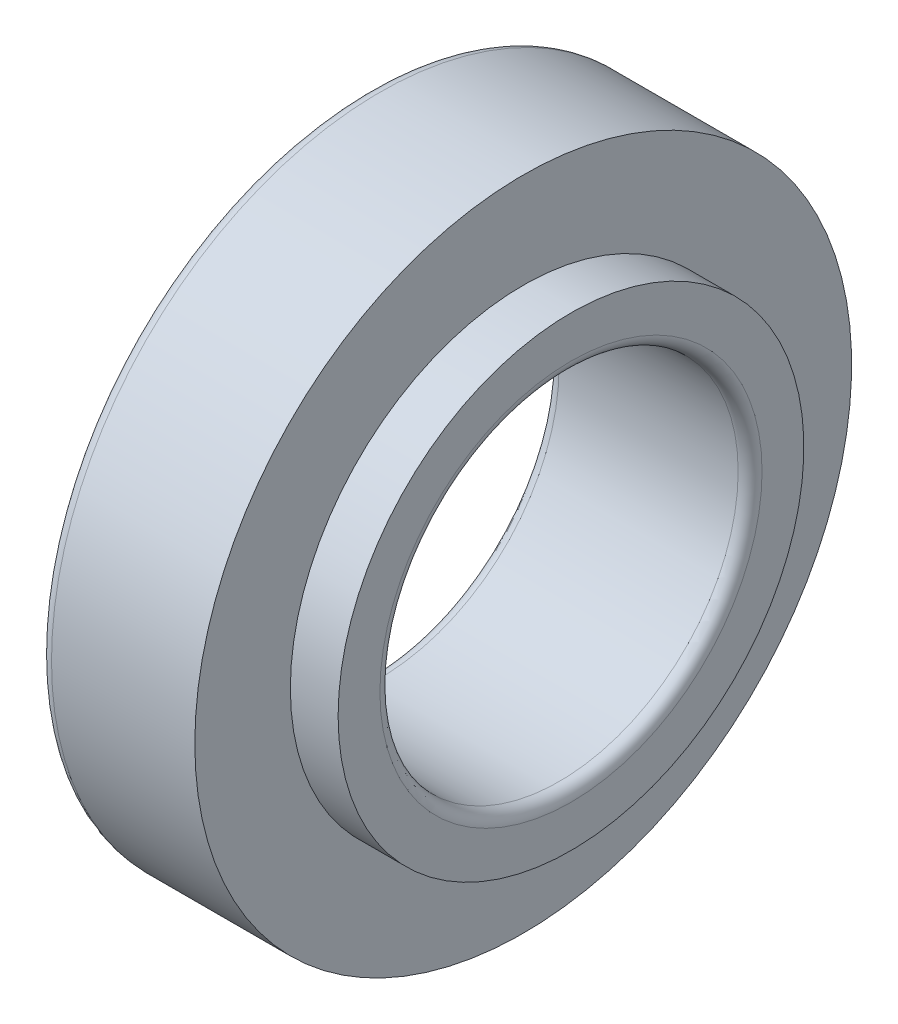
ISO-10303-21;
HEADER;
FILE_DESCRIPTION(('STEP AP214'),'2;1');
FILE_NAME('part.step','',(''),(''),'','','');
FILE_SCHEMA(('AUTOMOTIVE_DESIGN { 1 0 10303 214 1 1 1 1 }'));
ENDSEC;
DATA;
#1=APPLICATION_CONTEXT('core data for automotive mechanical design processes');
#2=APPLICATION_PROTOCOL_DEFINITION('international standard','automotive_design',2000,#1);
#3=PRODUCT_CONTEXT('',#1,'mechanical');
#4=PRODUCT('Part','Part','',(#3));
#5=PRODUCT_RELATED_PRODUCT_CATEGORY('part','',(#4));
#6=PRODUCT_DEFINITION_FORMATION('','',#4);
#7=PRODUCT_DEFINITION_CONTEXT('part definition',#1,'design');
#8=PRODUCT_DEFINITION('design','',#6,#7);
#9=PRODUCT_DEFINITION_SHAPE('','',#8);
#10=(LENGTH_UNIT() NAMED_UNIT(*) SI_UNIT(.MILLI.,.METRE.));
#11=(NAMED_UNIT(*) PLANE_ANGLE_UNIT() SI_UNIT($,.RADIAN.));
#12=(NAMED_UNIT(*) SI_UNIT($,.STERADIAN.) SOLID_ANGLE_UNIT());
#13=UNCERTAINTY_MEASURE_WITH_UNIT(LENGTH_MEASURE(1.E-05),#10,'distance_accuracy_value','');
#14=(GEOMETRIC_REPRESENTATION_CONTEXT(3) GLOBAL_UNCERTAINTY_ASSIGNED_CONTEXT((#13)) GLOBAL_UNIT_ASSIGNED_CONTEXT((#10,
#11,#12)) REPRESENTATION_CONTEXT('',''));
#15=CARTESIAN_POINT('',(0.,0.,0.));
#16=DIRECTION('',(0.,0.,1.));
#17=DIRECTION('',(1.,0.,0.));
#18=AXIS2_PLACEMENT_3D('',#15,#16,#17);
#19=CARTESIAN_POINT('',(12.9999999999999,27.4999999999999,0.));
#20=DIRECTION('',(-0.999999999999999,0.,0.));
#21=DIRECTION('',(0.,0.,1.));
#22=AXIS2_PLACEMENT_3D('',#19,#20,#21);
#23=PLANE('',#22);
#24=CARTESIAN_POINT('',(13.0000000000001,-2.25514051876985E-13,0.));
#25=DIRECTION('',(-0.999999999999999,0.,0.));
#26=DIRECTION('',(0.,0.,1.));
#27=AXIS2_PLACEMENT_3D('',#24,#25,#26);
#28=CIRCLE('',#27,27.5);
#29=CARTESIAN_POINT('',(13.0000000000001,0.,27.5));
#30=VERTEX_POINT('',#29);
#31=EDGE_CURVE('E77',#30,#30,#28,.T.);
#32=ORIENTED_EDGE('',*,*,#31,.F.);
#33=EDGE_LOOP('',(#32));
#34=FACE_BOUND('',#33,.T.);
#35=CARTESIAN_POINT('',(13.0000000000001,-2.25514051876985E-13,0.));
#36=DIRECTION('',(-0.999999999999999,0.,0.));
#37=DIRECTION('',(0.,0.,1.));
#38=AXIS2_PLACEMENT_3D('',#35,#36,#37);
#39=CIRCLE('',#38,19.5);
#40=CARTESIAN_POINT('',(13.0000000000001,0.,19.5));
#41=VERTEX_POINT('',#40);
#42=EDGE_CURVE('E10',#41,#41,#39,.T.);
#43=ORIENTED_EDGE('',*,*,#42,.T.);
#44=EDGE_LOOP('',(#43));
#45=FACE_BOUND('',#44,.T.);
#46=ADVANCED_FACE('F34',(#34,#45),#23,.F.);
#47=CARTESIAN_POINT('',(0.,0.,0.));
#48=DIRECTION('',(-0.999999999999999,0.,0.));
#49=DIRECTION('',(0.,0.,1.));
#50=AXIS2_PLACEMENT_3D('',#47,#48,#49);
#51=CYLINDRICAL_SURFACE('',#50,19.5);
#52=CARTESIAN_POINT('',(17.,-2.22044604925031E-13,1.11022302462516E-13));
#53=DIRECTION('',(-0.999999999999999,0.,0.));
#54=DIRECTION('',(0.,0.,1.));
#55=AXIS2_PLACEMENT_3D('',#52,#53,#54);
#56=CIRCLE('',#55,19.5);
#57=CARTESIAN_POINT('',(17.,0.,19.5));
#58=VERTEX_POINT('',#57);
#59=EDGE_CURVE('E40',#58,#58,#56,.T.);
#60=CARTESIAN_POINT('',(13.0000000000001,0.,19.5));
#61=CARTESIAN_POINT('',(13.0416666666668,0.,19.5));
#62=CARTESIAN_POINT('',(13.0833333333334,0.,19.5));
#63=CARTESIAN_POINT('',(13.1666666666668,0.,19.5));
#64=CARTESIAN_POINT('',(13.2083333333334,0.,19.5));
#65=CARTESIAN_POINT('',(13.2916666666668,0.,19.5));
#66=CARTESIAN_POINT('',(13.3333333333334,0.,19.5));
#67=CARTESIAN_POINT('',(13.4166666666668,0.,19.5));
#68=CARTESIAN_POINT('',(13.4583333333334,0.,19.5));
#69=CARTESIAN_POINT('',(13.5416666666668,0.,19.5));
#70=CARTESIAN_POINT('',(13.5833333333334,0.,19.5));
#71=CARTESIAN_POINT('',(13.6666666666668,0.,19.5));
#72=CARTESIAN_POINT('',(13.7083333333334,0.,19.5));
#73=CARTESIAN_POINT('',(13.7916666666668,0.,19.5));
#74=CARTESIAN_POINT('',(13.8333333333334,0.,19.5));
#75=CARTESIAN_POINT('',(13.9166666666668,0.,19.5));
#76=CARTESIAN_POINT('',(13.9583333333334,0.,19.5));
#77=CARTESIAN_POINT('',(14.0416666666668,0.,19.5));
#78=CARTESIAN_POINT('',(14.0833333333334,0.,19.5));
#79=CARTESIAN_POINT('',(14.1666666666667,0.,19.5));
#80=CARTESIAN_POINT('',(14.2083333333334,0.,19.5));
#81=CARTESIAN_POINT('',(14.2916666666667,0.,19.5));
#82=CARTESIAN_POINT('',(14.3333333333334,0.,19.5));
#83=CARTESIAN_POINT('',(14.4166666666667,0.,19.5));
#84=CARTESIAN_POINT('',(14.4583333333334,0.,19.5));
#85=CARTESIAN_POINT('',(14.5416666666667,0.,19.5));
#86=CARTESIAN_POINT('',(14.5833333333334,0.,19.5));
#87=CARTESIAN_POINT('',(14.6666666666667,0.,19.5));
#88=CARTESIAN_POINT('',(14.7083333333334,0.,19.5));
#89=CARTESIAN_POINT('',(14.7916666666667,0.,19.5));
#90=CARTESIAN_POINT('',(14.8333333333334,0.,19.5));
#91=CARTESIAN_POINT('',(14.9166666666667,0.,19.5));
#92=CARTESIAN_POINT('',(14.9583333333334,0.,19.5));
#93=CARTESIAN_POINT('',(15.0416666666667,0.,19.5));
#94=CARTESIAN_POINT('',(15.0833333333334,0.,19.5));
#95=CARTESIAN_POINT('',(15.1666666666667,0.,19.5));
#96=CARTESIAN_POINT('',(15.2083333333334,0.,19.5));
#97=CARTESIAN_POINT('',(15.2916666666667,0.,19.5));
#98=CARTESIAN_POINT('',(15.3333333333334,0.,19.5));
#99=CARTESIAN_POINT('',(15.4166666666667,0.,19.5));
#100=CARTESIAN_POINT('',(15.4583333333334,0.,19.5));
#101=CARTESIAN_POINT('',(15.5416666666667,0.,19.5));
#102=CARTESIAN_POINT('',(15.5833333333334,0.,19.5));
#103=CARTESIAN_POINT('',(15.6666666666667,0.,19.5));
#104=CARTESIAN_POINT('',(15.7083333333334,0.,19.5));
#105=CARTESIAN_POINT('',(15.7916666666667,0.,19.5));
#106=CARTESIAN_POINT('',(15.8333333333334,0.,19.5));
#107=CARTESIAN_POINT('',(15.9166666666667,0.,19.5));
#108=CARTESIAN_POINT('',(15.9583333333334,0.,19.5));
#109=CARTESIAN_POINT('',(16.0416666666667,0.,19.5));
#110=CARTESIAN_POINT('',(16.0833333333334,0.,19.5));
#111=CARTESIAN_POINT('',(16.1666666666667,0.,19.5));
#112=CARTESIAN_POINT('',(16.2083333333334,0.,19.5));
#113=CARTESIAN_POINT('',(16.2916666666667,0.,19.5));
#114=CARTESIAN_POINT('',(16.3333333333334,0.,19.5));
#115=CARTESIAN_POINT('',(16.4166666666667,0.,19.5));
#116=CARTESIAN_POINT('',(16.4583333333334,0.,19.5));
#117=CARTESIAN_POINT('',(16.5416666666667,0.,19.5));
#118=CARTESIAN_POINT('',(16.5833333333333,0.,19.5));
#119=CARTESIAN_POINT('',(16.6666666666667,0.,19.5));
#120=CARTESIAN_POINT('',(16.7083333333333,0.,19.5));
#121=CARTESIAN_POINT('',(16.7916666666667,0.,19.5));
#122=CARTESIAN_POINT('',(16.8333333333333,0.,19.5));
#123=CARTESIAN_POINT('',(16.9166666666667,0.,19.5));
#124=CARTESIAN_POINT('',(16.9583333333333,0.,19.5));
#125=CARTESIAN_POINT('',(17.,0.,19.5));
#126=B_SPLINE_CURVE_WITH_KNOTS('',3,(#60,#61,#62,#63,#64,#65,#66,#67,#68,#69,#70,#71,#72,#73,
#74,#75,#76,#77,#78,#79,#80,#81,#82,#83,#84,#85,#86,#87,#88,#89,#90,#91,#92,#93,#94,#95,#96,#97,
#98,#99,#100,#101,#102,#103,#104,#105,#106,#107,#108,#109,#110,#111,#112,#113,#114,#115,#116,
#117,#118,#119,#120,#121,#122,#123,#124,#125),.UNSPECIFIED.,.F.,.F.,(4,2,2,2,2,2,2,2,2,2,2,2,2,
2,2,2,2,2,2,2,2,2,2,2,2,2,2,2,2,2,2,2,4),(0.,0.124999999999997,0.249999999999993,
0.374999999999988,0.499999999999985,0.624999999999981,0.749999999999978,0.874999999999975,
0.999999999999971,1.12499999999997,1.24999999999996,1.37499999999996,1.49999999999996,
1.62499999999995,1.74999999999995,1.87499999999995,1.99999999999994,2.12499999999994,
2.24999999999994,2.37499999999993,2.49999999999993,2.62499999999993,2.74999999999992,
2.87499999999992,2.99999999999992,3.12499999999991,3.24999999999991,3.37499999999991,
3.4999999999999,3.6249999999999,3.7499999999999,3.87499999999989,3.99999999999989),.UNSPECIFIED.);
#127=EDGE_CURVE('BSEAM84',#41,#58,#126,.T.);
#128=ORIENTED_EDGE('',*,*,#42,.F.);
#129=ORIENTED_EDGE('',*,*,#59,.T.);
#130=ORIENTED_EDGE('',*,*,#127,.T.);
#131=ORIENTED_EDGE('',*,*,#127,.F.);
#132=EDGE_LOOP('',(#128,#130,#129,#131));
#133=FACE_BOUND('',#132,.T.);
#134=ADVANCED_FACE('F84',(#133),#51,.T.);
#135=CARTESIAN_POINT('',(16.9999999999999,19.4999999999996,0.));
#136=DIRECTION('',(-0.999999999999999,0.,0.));
#137=DIRECTION('',(0.,0.,1.));
#138=AXIS2_PLACEMENT_3D('',#135,#136,#137);
#139=PLANE('',#138);
#140=ORIENTED_EDGE('',*,*,#59,.F.);
#141=EDGE_LOOP('',(#140));
#142=FACE_BOUND('',#141,.T.);
#143=CARTESIAN_POINT('',(17.,-2.22044604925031E-13,1.11022302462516E-13));
#144=DIRECTION('',(-0.999999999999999,0.,0.));
#145=DIRECTION('',(0.,0.,1.));
#146=AXIS2_PLACEMENT_3D('',#143,#144,#145);
#147=CIRCLE('',#146,16.);
#148=CARTESIAN_POINT('',(17.,-2.22044604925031E-13,16.0000000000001));
#149=VERTEX_POINT('',#148);
#150=EDGE_CURVE('E44',#149,#149,#147,.T.);
#151=ORIENTED_EDGE('',*,*,#150,.T.);
#152=EDGE_LOOP('',(#151));
#153=FACE_BOUND('',#152,.T.);
#154=ADVANCED_FACE('F88',(#142,#153),#139,.F.);
#155=CARTESIAN_POINT('',(15.9999999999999,-2.22044604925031E-13,0.));
#156=DIRECTION('',(-0.999999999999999,0.,0.));
#157=DIRECTION('',(0.,0.,1.));
#158=AXIS2_PLACEMENT_3D('',#155,#156,#157);
#159=TOROIDAL_SURFACE('',#158,16.,1.);
#160=ORIENTED_EDGE('',*,*,#150,.F.);
#161=EDGE_LOOP('',(#160));
#162=FACE_BOUND('',#161,.T.);
#163=CARTESIAN_POINT('',(15.9999999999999,-2.22044604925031E-13,0.));
#164=DIRECTION('',(-0.999999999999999,0.,0.));
#165=DIRECTION('',(0.,0.,1.));
#166=AXIS2_PLACEMENT_3D('',#163,#164,#165);
#167=CIRCLE('',#166,15.);
#168=CARTESIAN_POINT('',(15.9999999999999,0.,15.));
#169=VERTEX_POINT('',#168);
#170=EDGE_CURVE('E48',#169,#169,#167,.T.);
#171=ORIENTED_EDGE('',*,*,#170,.T.);
#172=EDGE_LOOP('',(#171));
#173=FACE_BOUND('',#172,.T.);
#174=ADVANCED_FACE('F93',(#162,#173),#159,.T.);
#175=CARTESIAN_POINT('',(0.,0.,0.));
#176=DIRECTION('',(-0.999999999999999,0.,0.));
#177=DIRECTION('',(0.,0.,1.));
#178=AXIS2_PLACEMENT_3D('',#175,#176,#177);
#179=CYLINDRICAL_SURFACE('',#178,15.);
#180=CARTESIAN_POINT('',(1.,-2.25514051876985E-13,0.));
#181=DIRECTION('',(-0.999999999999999,0.,0.));
#182=DIRECTION('',(0.,0.,1.));
#183=AXIS2_PLACEMENT_3D('',#180,#181,#182);
#184=CIRCLE('',#183,15.);
#185=CARTESIAN_POINT('',(1.,0.,15.));
#186=VERTEX_POINT('',#185);
#187=EDGE_CURVE('E53',#186,#186,#184,.T.);
#188=CARTESIAN_POINT('',(15.9999999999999,0.,15.));
#189=CARTESIAN_POINT('',(15.8437499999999,0.,15.));
#190=CARTESIAN_POINT('',(15.6874999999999,0.,15.));
#191=CARTESIAN_POINT('',(15.3749999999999,0.,15.));
#192=CARTESIAN_POINT('',(15.2187499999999,0.,15.));
#193=CARTESIAN_POINT('',(14.9062499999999,0.,15.));
#194=CARTESIAN_POINT('',(14.7499999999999,0.,15.));
#195=CARTESIAN_POINT('',(14.4374999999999,0.,15.));
#196=CARTESIAN_POINT('',(14.2812499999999,0.,15.));
#197=CARTESIAN_POINT('',(13.9687499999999,0.,15.));
#198=CARTESIAN_POINT('',(13.8124999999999,0.,15.));
#199=CARTESIAN_POINT('',(13.4999999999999,0.,15.));
#200=CARTESIAN_POINT('',(13.3437499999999,0.,15.));
#201=CARTESIAN_POINT('',(13.0312499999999,0.,15.));
#202=CARTESIAN_POINT('',(12.8749999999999,0.,15.));
#203=CARTESIAN_POINT('',(12.5624999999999,0.,15.));
#204=CARTESIAN_POINT('',(12.4062499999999,0.,15.));
#205=CARTESIAN_POINT('',(12.0937499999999,0.,15.));
#206=CARTESIAN_POINT('',(11.9374999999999,0.,15.));
#207=CARTESIAN_POINT('',(11.6249999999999,0.,15.));
#208=CARTESIAN_POINT('',(11.4687499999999,0.,15.));
#209=CARTESIAN_POINT('',(11.1562499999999,0.,15.));
#210=CARTESIAN_POINT('',(10.9999999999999,0.,15.));
#211=CARTESIAN_POINT('',(10.6874999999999,0.,15.));
#212=CARTESIAN_POINT('',(10.5312499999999,0.,15.));
#213=CARTESIAN_POINT('',(10.2187499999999,0.,15.));
#214=CARTESIAN_POINT('',(10.0624999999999,0.,15.));
#215=CARTESIAN_POINT('',(9.74999999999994,0.,15.));
#216=CARTESIAN_POINT('',(9.59374999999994,0.,15.));
#217=CARTESIAN_POINT('',(9.28124999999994,0.,15.));
#218=CARTESIAN_POINT('',(9.12499999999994,0.,15.));
#219=CARTESIAN_POINT('',(8.81249999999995,0.,15.));
#220=CARTESIAN_POINT('',(8.65624999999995,0.,15.));
#221=CARTESIAN_POINT('',(8.34374999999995,0.,15.));
#222=CARTESIAN_POINT('',(8.18749999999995,0.,15.));
#223=CARTESIAN_POINT('',(7.87499999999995,0.,15.));
#224=CARTESIAN_POINT('',(7.71874999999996,0.,15.));
#225=CARTESIAN_POINT('',(7.40624999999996,0.,15.));
#226=CARTESIAN_POINT('',(7.24999999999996,0.,15.));
#227=CARTESIAN_POINT('',(6.93749999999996,0.,15.));
#228=CARTESIAN_POINT('',(6.78124999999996,0.,15.));
#229=CARTESIAN_POINT('',(6.46874999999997,0.,15.));
#230=CARTESIAN_POINT('',(6.31249999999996,0.,15.));
#231=CARTESIAN_POINT('',(5.99999999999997,0.,15.));
#232=CARTESIAN_POINT('',(5.84374999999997,0.,15.));
#233=CARTESIAN_POINT('',(5.53124999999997,0.,15.));
#234=CARTESIAN_POINT('',(5.37499999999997,0.,15.));
#235=CARTESIAN_POINT('',(5.06249999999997,0.,15.));
#236=CARTESIAN_POINT('',(4.90624999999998,0.,15.));
#237=CARTESIAN_POINT('',(4.59374999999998,0.,15.));
#238=CARTESIAN_POINT('',(4.43749999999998,0.,15.));
#239=CARTESIAN_POINT('',(4.12499999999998,0.,15.));
#240=CARTESIAN_POINT('',(3.96874999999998,0.,15.));
#241=CARTESIAN_POINT('',(3.65624999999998,0.,15.));
#242=CARTESIAN_POINT('',(3.49999999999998,0.,15.));
#243=CARTESIAN_POINT('',(3.18749999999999,0.,15.));
#244=CARTESIAN_POINT('',(3.03124999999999,0.,15.));
#245=CARTESIAN_POINT('',(2.71874999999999,0.,15.));
#246=CARTESIAN_POINT('',(2.56249999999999,0.,15.));
#247=CARTESIAN_POINT('',(2.24999999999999,0.,15.));
#248=CARTESIAN_POINT('',(2.09374999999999,0.,15.));
#249=CARTESIAN_POINT('',(1.78125,0.,15.));
#250=CARTESIAN_POINT('',(1.625,0.,15.));
#251=CARTESIAN_POINT('',(1.3125,0.,15.));
#252=CARTESIAN_POINT('',(1.15625,0.,15.));
#253=CARTESIAN_POINT('',(1.,0.,15.));
#254=B_SPLINE_CURVE_WITH_KNOTS('',3,(#188,#189,#190,#191,#192,#193,#194,#195,#196,#197,#198,
#199,#200,#201,#202,#203,#204,#205,#206,#207,#208,#209,#210,#211,#212,#213,#214,#215,#216,#217,
#218,#219,#220,#221,#222,#223,#224,#225,#226,#227,#228,#229,#230,#231,#232,#233,#234,#235,#236,
#237,#238,#239,#240,#241,#242,#243,#244,#245,#246,#247,#248,#249,#250,#251,#252,#253),
.UNSPECIFIED.,.F.,.F.,(4,2,2,2,2,2,2,2,2,2,2,2,2,2,2,2,2,2,2,2,2,2,2,2,2,2,2,2,2,2,2,2,4),(0.,
0.468749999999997,0.937499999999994,1.40624999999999,1.87499999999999,2.34374999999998,
2.81249999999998,3.28124999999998,3.74999999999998,4.21874999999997,4.68749999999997,
5.15624999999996,5.62499999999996,6.09374999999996,6.56249999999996,7.03124999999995,
7.49999999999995,7.96874999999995,8.43749999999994,8.90624999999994,9.37499999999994,
9.84374999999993,10.3124999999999,10.7812499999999,11.2499999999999,11.7187499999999,
12.1874999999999,12.6562499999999,13.1249999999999,13.5937499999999,14.0624999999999,
14.5312499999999,14.9999999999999),.UNSPECIFIED.);
#255=EDGE_CURVE('BSEAM99',#169,#186,#254,.T.);
#256=ORIENTED_EDGE('',*,*,#170,.F.);
#257=ORIENTED_EDGE('',*,*,#187,.T.);
#258=ORIENTED_EDGE('',*,*,#255,.T.);
#259=ORIENTED_EDGE('',*,*,#255,.F.);
#260=EDGE_LOOP('',(#256,#258,#257,#259));
#261=FACE_BOUND('',#260,.T.);
#262=ADVANCED_FACE('F99',(#261),#179,.F.);
#263=CARTESIAN_POINT('',(1.,-2.25514051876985E-13,0.));
#264=DIRECTION('',(-0.999999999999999,0.,0.));
#265=DIRECTION('',(0.,0.,1.));
#266=AXIS2_PLACEMENT_3D('',#263,#264,#265);
#267=TOROIDAL_SURFACE('',#266,16.,0.999999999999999);
#268=ORIENTED_EDGE('',*,*,#187,.F.);
#269=EDGE_LOOP('',(#268));
#270=FACE_BOUND('',#269,.T.);
#271=CARTESIAN_POINT('',(0.,0.,0.));
#272=DIRECTION('',(-0.999999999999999,0.,0.));
#273=DIRECTION('',(0.,0.,1.));
#274=AXIS2_PLACEMENT_3D('',#271,#272,#273);
#275=CIRCLE('',#274,16.);
#276=CARTESIAN_POINT('',(0.,0.,16.));
#277=VERTEX_POINT('',#276);
#278=EDGE_CURVE('E56',#277,#277,#275,.T.);
#279=ORIENTED_EDGE('',*,*,#278,.T.);
#280=EDGE_LOOP('',(#279));
#281=FACE_BOUND('',#280,.T.);
#282=ADVANCED_FACE('F103',(#270,#281),#267,.T.);
#283=CARTESIAN_POINT('',(0.,15.9999999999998,0.));
#284=DIRECTION('',(0.999999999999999,0.,0.));
#285=DIRECTION('',(0.,0.,-1.));
#286=AXIS2_PLACEMENT_3D('',#283,#284,#285);
#287=PLANE('',#286);
#288=ORIENTED_EDGE('',*,*,#278,.F.);
#289=EDGE_LOOP('',(#288));
#290=FACE_BOUND('',#289,.T.);
#291=CARTESIAN_POINT('',(0.,0.,0.));
#292=DIRECTION('',(-0.999999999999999,0.,0.));
#293=DIRECTION('',(0.,0.,1.));
#294=AXIS2_PLACEMENT_3D('',#291,#292,#293);
#295=CIRCLE('',#294,17.5);
#296=CARTESIAN_POINT('',(0.,0.,17.5));
#297=VERTEX_POINT('',#296);
#298=EDGE_CURVE('E59',#297,#297,#295,.T.);
#299=ORIENTED_EDGE('',*,*,#298,.T.);
#300=EDGE_LOOP('',(#299));
#301=FACE_BOUND('',#300,.T.);
#302=ADVANCED_FACE('F107',(#290,#301),#287,.F.);
#303=CARTESIAN_POINT('',(0.,0.,0.));
#304=DIRECTION('',(-0.999999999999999,0.,0.));
#305=DIRECTION('',(0.,0.,1.));
#306=AXIS2_PLACEMENT_3D('',#303,#304,#305);
#307=CYLINDRICAL_SURFACE('',#306,17.5);
#308=CARTESIAN_POINT('',(4.00000000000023,-2.18575157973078E-13,0.));
#309=DIRECTION('',(-0.999999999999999,0.,0.));
#310=DIRECTION('',(0.,0.,1.));
#311=AXIS2_PLACEMENT_3D('',#308,#309,#310);
#312=CIRCLE('',#311,17.5);
#313=CARTESIAN_POINT('',(4.00000000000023,0.,17.5));
#314=VERTEX_POINT('',#313);
#315=EDGE_CURVE('E62',#314,#314,#312,.T.);
#316=CARTESIAN_POINT('',(0.,0.,17.5));
#317=CARTESIAN_POINT('',(0.0416666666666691,0.,17.5));
#318=CARTESIAN_POINT('',(0.0833333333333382,0.,17.5));
#319=CARTESIAN_POINT('',(0.166666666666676,0.,17.5));
#320=CARTESIAN_POINT('',(0.208333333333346,0.,17.5));
#321=CARTESIAN_POINT('',(0.291666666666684,0.,17.5));
#322=CARTESIAN_POINT('',(0.333333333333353,0.,17.5));
#323=CARTESIAN_POINT('',(0.416666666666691,0.,17.5));
#324=CARTESIAN_POINT('',(0.45833333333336,0.,17.5));
#325=CARTESIAN_POINT('',(0.541666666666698,0.,17.5));
#326=CARTESIAN_POINT('',(0.583333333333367,0.,17.5));
#327=CARTESIAN_POINT('',(0.666666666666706,0.,17.5));
#328=CARTESIAN_POINT('',(0.708333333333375,0.,17.5));
#329=CARTESIAN_POINT('',(0.791666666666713,0.,17.5));
#330=CARTESIAN_POINT('',(0.833333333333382,0.,17.5));
#331=CARTESIAN_POINT('',(0.91666666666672,0.,17.5));
#332=CARTESIAN_POINT('',(0.958333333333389,0.,17.5));
#333=CARTESIAN_POINT('',(1.04166666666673,0.,17.5));
#334=CARTESIAN_POINT('',(1.0833333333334,0.,17.5));
#335=CARTESIAN_POINT('',(1.16666666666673,0.,17.5));
#336=CARTESIAN_POINT('',(1.2083333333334,0.,17.5));
#337=CARTESIAN_POINT('',(1.29166666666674,0.,17.5));
#338=CARTESIAN_POINT('',(1.33333333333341,0.,17.5));
#339=CARTESIAN_POINT('',(1.41666666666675,0.,17.5));
#340=CARTESIAN_POINT('',(1.45833333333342,0.,17.5));
#341=CARTESIAN_POINT('',(1.54166666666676,0.,17.5));
#342=CARTESIAN_POINT('',(1.58333333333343,0.,17.5));
#343=CARTESIAN_POINT('',(1.66666666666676,0.,17.5));
#344=CARTESIAN_POINT('',(1.70833333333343,0.,17.5));
#345=CARTESIAN_POINT('',(1.79166666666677,0.,17.5));
#346=CARTESIAN_POINT('',(1.83333333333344,0.,17.5));
#347=CARTESIAN_POINT('',(1.91666666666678,0.,17.5));
#348=CARTESIAN_POINT('',(1.95833333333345,0.,17.5));
#349=CARTESIAN_POINT('',(2.04166666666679,0.,17.5));
#350=CARTESIAN_POINT('',(2.08333333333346,0.,17.5));
#351=CARTESIAN_POINT('',(2.16666666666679,0.,17.5));
#352=CARTESIAN_POINT('',(2.20833333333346,0.,17.5));
#353=CARTESIAN_POINT('',(2.2916666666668,0.,17.5));
#354=CARTESIAN_POINT('',(2.33333333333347,0.,17.5));
#355=CARTESIAN_POINT('',(2.41666666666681,0.,17.5));
#356=CARTESIAN_POINT('',(2.45833333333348,0.,17.5));
#357=CARTESIAN_POINT('',(2.54166666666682,0.,17.5));
#358=CARTESIAN_POINT('',(2.58333333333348,0.,17.5));
#359=CARTESIAN_POINT('',(2.66666666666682,0.,17.5));
#360=CARTESIAN_POINT('',(2.70833333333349,0.,17.5));
#361=CARTESIAN_POINT('',(2.79166666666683,0.,17.5));
#362=CARTESIAN_POINT('',(2.8333333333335,0.,17.5));
#363=CARTESIAN_POINT('',(2.91666666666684,0.,17.5));
#364=CARTESIAN_POINT('',(2.95833333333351,0.,17.5));
#365=CARTESIAN_POINT('',(3.04166666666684,0.,17.5));
#366=CARTESIAN_POINT('',(3.08333333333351,0.,17.5));
#367=CARTESIAN_POINT('',(3.16666666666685,0.,17.5));
#368=CARTESIAN_POINT('',(3.20833333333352,0.,17.5));
#369=CARTESIAN_POINT('',(3.29166666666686,0.,17.5));
#370=CARTESIAN_POINT('',(3.33333333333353,0.,17.5));
#371=CARTESIAN_POINT('',(3.41666666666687,0.,17.5));
#372=CARTESIAN_POINT('',(3.45833333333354,0.,17.5));
#373=CARTESIAN_POINT('',(3.54166666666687,0.,17.5));
#374=CARTESIAN_POINT('',(3.58333333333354,0.,17.5));
#375=CARTESIAN_POINT('',(3.66666666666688,0.,17.5));
#376=CARTESIAN_POINT('',(3.70833333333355,0.,17.5));
#377=CARTESIAN_POINT('',(3.79166666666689,0.,17.5));
#378=CARTESIAN_POINT('',(3.83333333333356,0.,17.5));
#379=CARTESIAN_POINT('',(3.9166666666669,0.,17.5));
#380=CARTESIAN_POINT('',(3.95833333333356,0.,17.5));
#381=CARTESIAN_POINT('',(4.00000000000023,0.,17.5));
#382=B_SPLINE_CURVE_WITH_KNOTS('',3,(#316,#317,#318,#319,#320,#321,#322,#323,#324,#325,#326,
#327,#328,#329,#330,#331,#332,#333,#334,#335,#336,#337,#338,#339,#340,#341,#342,#343,#344,#345,
#346,#347,#348,#349,#350,#351,#352,#353,#354,#355,#356,#357,#358,#359,#360,#361,#362,#363,#364,
#365,#366,#367,#368,#369,#370,#371,#372,#373,#374,#375,#376,#377,#378,#379,#380,#381),
.UNSPECIFIED.,.F.,.F.,(4,2,2,2,2,2,2,2,2,2,2,2,2,2,2,2,2,2,2,2,2,2,2,2,2,2,2,2,2,2,2,2,4),(0.,
0.125000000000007,0.250000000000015,0.375000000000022,0.500000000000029,0.625000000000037,
0.750000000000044,0.875000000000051,1.00000000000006,1.12500000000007,1.25000000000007,
1.37500000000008,1.50000000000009,1.62500000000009,1.7500000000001,1.87500000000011,
2.00000000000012,2.12500000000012,2.25000000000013,2.37500000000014,2.50000000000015,
2.62500000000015,2.75000000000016,2.87500000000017,3.00000000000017,3.12500000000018,
3.25000000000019,3.3750000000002,3.5000000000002,3.62500000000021,3.75000000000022,
3.87500000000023,4.00000000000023),.UNSPECIFIED.);
#383=EDGE_CURVE('BSEAM111',#297,#314,#382,.T.);
#384=ORIENTED_EDGE('',*,*,#298,.F.);
#385=ORIENTED_EDGE('',*,*,#315,.T.);
#386=ORIENTED_EDGE('',*,*,#383,.T.);
#387=ORIENTED_EDGE('',*,*,#383,.F.);
#388=EDGE_LOOP('',(#384,#386,#385,#387));
#389=FACE_BOUND('',#388,.T.);
#390=ADVANCED_FACE('F111',(#389),#307,.T.);
#391=CARTESIAN_POINT('',(4.,23.9999999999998,0.));
#392=DIRECTION('',(0.999999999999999,0.,0.));
#393=DIRECTION('',(0.,0.,-1.));
#394=AXIS2_PLACEMENT_3D('',#391,#392,#393);
#395=PLANE('',#394);
#396=ORIENTED_EDGE('',*,*,#315,.F.);
#397=EDGE_LOOP('',(#396));
#398=FACE_BOUND('',#397,.T.);
#399=CARTESIAN_POINT('',(4.00000000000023,-2.18575157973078E-13,0.));
#400=DIRECTION('',(-0.999999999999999,0.,0.));
#401=DIRECTION('',(0.,0.,1.));
#402=AXIS2_PLACEMENT_3D('',#399,#400,#401);
#403=CIRCLE('',#402,24.);
#404=CARTESIAN_POINT('',(4.00000000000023,0.,24.));
#405=VERTEX_POINT('',#404);
#406=EDGE_CURVE('E65',#405,#405,#403,.T.);
#407=ORIENTED_EDGE('',*,*,#406,.T.);
#408=EDGE_LOOP('',(#407));
#409=FACE_BOUND('',#408,.T.);
#410=ADVANCED_FACE('F115',(#398,#409),#395,.F.);
#411=CARTESIAN_POINT('',(0.,0.,0.));
#412=DIRECTION('',(-0.999999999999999,0.,0.));
#413=DIRECTION('',(0.,0.,1.));
#414=AXIS2_PLACEMENT_3D('',#411,#412,#413);
#415=CYLINDRICAL_SURFACE('',#414,24.);
#416=CARTESIAN_POINT('',(0.,0.,0.));
#417=DIRECTION('',(-0.999999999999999,0.,0.));
#418=DIRECTION('',(0.,0.,1.));
#419=AXIS2_PLACEMENT_3D('',#416,#417,#418);
#420=CIRCLE('',#419,24.);
#421=CARTESIAN_POINT('',(0.,0.,24.));
#422=VERTEX_POINT('',#421);
#423=EDGE_CURVE('E68',#422,#422,#420,.T.);
#424=CARTESIAN_POINT('',(4.00000000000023,0.,24.));
#425=CARTESIAN_POINT('',(3.95833333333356,0.,24.));
#426=CARTESIAN_POINT('',(3.9166666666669,0.,24.));
#427=CARTESIAN_POINT('',(3.83333333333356,0.,24.));
#428=CARTESIAN_POINT('',(3.79166666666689,0.,24.));
#429=CARTESIAN_POINT('',(3.70833333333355,0.,24.));
#430=CARTESIAN_POINT('',(3.66666666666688,0.,24.));
#431=CARTESIAN_POINT('',(3.58333333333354,0.,24.));
#432=CARTESIAN_POINT('',(3.54166666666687,0.,24.));
#433=CARTESIAN_POINT('',(3.45833333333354,0.,24.));
#434=CARTESIAN_POINT('',(3.41666666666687,0.,24.));
#435=CARTESIAN_POINT('',(3.33333333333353,0.,24.));
#436=CARTESIAN_POINT('',(3.29166666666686,0.,24.));
#437=CARTESIAN_POINT('',(3.20833333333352,0.,24.));
#438=CARTESIAN_POINT('',(3.16666666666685,0.,24.));
#439=CARTESIAN_POINT('',(3.08333333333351,0.,24.));
#440=CARTESIAN_POINT('',(3.04166666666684,0.,24.));
#441=CARTESIAN_POINT('',(2.95833333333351,0.,24.));
#442=CARTESIAN_POINT('',(2.91666666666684,0.,24.));
#443=CARTESIAN_POINT('',(2.8333333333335,0.,24.));
#444=CARTESIAN_POINT('',(2.79166666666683,0.,24.));
#445=CARTESIAN_POINT('',(2.70833333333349,0.,24.));
#446=CARTESIAN_POINT('',(2.66666666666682,0.,24.));
#447=CARTESIAN_POINT('',(2.58333333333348,0.,24.));
#448=CARTESIAN_POINT('',(2.54166666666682,0.,24.));
#449=CARTESIAN_POINT('',(2.45833333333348,0.,24.));
#450=CARTESIAN_POINT('',(2.41666666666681,0.,24.));
#451=CARTESIAN_POINT('',(2.33333333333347,0.,24.));
#452=CARTESIAN_POINT('',(2.2916666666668,0.,24.));
#453=CARTESIAN_POINT('',(2.20833333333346,0.,24.));
#454=CARTESIAN_POINT('',(2.16666666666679,0.,24.));
#455=CARTESIAN_POINT('',(2.08333333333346,0.,24.));
#456=CARTESIAN_POINT('',(2.04166666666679,0.,24.));
#457=CARTESIAN_POINT('',(1.95833333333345,0.,24.));
#458=CARTESIAN_POINT('',(1.91666666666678,0.,24.));
#459=CARTESIAN_POINT('',(1.83333333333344,0.,24.));
#460=CARTESIAN_POINT('',(1.79166666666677,0.,24.));
#461=CARTESIAN_POINT('',(1.70833333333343,0.,24.));
#462=CARTESIAN_POINT('',(1.66666666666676,0.,24.));
#463=CARTESIAN_POINT('',(1.58333333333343,0.,24.));
#464=CARTESIAN_POINT('',(1.54166666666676,0.,24.));
#465=CARTESIAN_POINT('',(1.45833333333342,0.,24.));
#466=CARTESIAN_POINT('',(1.41666666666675,0.,24.));
#467=CARTESIAN_POINT('',(1.33333333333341,0.,24.));
#468=CARTESIAN_POINT('',(1.29166666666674,0.,24.));
#469=CARTESIAN_POINT('',(1.2083333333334,0.,24.));
#470=CARTESIAN_POINT('',(1.16666666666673,0.,24.));
#471=CARTESIAN_POINT('',(1.0833333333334,0.,24.));
#472=CARTESIAN_POINT('',(1.04166666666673,0.,24.));
#473=CARTESIAN_POINT('',(0.958333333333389,0.,24.));
#474=CARTESIAN_POINT('',(0.91666666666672,0.,24.));
#475=CARTESIAN_POINT('',(0.833333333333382,0.,24.));
#476=CARTESIAN_POINT('',(0.791666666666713,0.,24.));
#477=CARTESIAN_POINT('',(0.708333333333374,0.,24.));
#478=CARTESIAN_POINT('',(0.666666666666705,0.,24.));
#479=CARTESIAN_POINT('',(0.583333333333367,0.,24.));
#480=CARTESIAN_POINT('',(0.541666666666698,0.,24.));
#481=CARTESIAN_POINT('',(0.45833333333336,0.,24.));
#482=CARTESIAN_POINT('',(0.416666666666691,0.,24.));
#483=CARTESIAN_POINT('',(0.333333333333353,0.,24.));
#484=CARTESIAN_POINT('',(0.291666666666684,0.,24.));
#485=CARTESIAN_POINT('',(0.208333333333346,0.,24.));
#486=CARTESIAN_POINT('',(0.166666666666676,0.,24.));
#487=CARTESIAN_POINT('',(0.0833333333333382,0.,24.));
#488=CARTESIAN_POINT('',(0.041666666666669,0.,24.));
#489=CARTESIAN_POINT('',(0.,0.,24.));
#490=B_SPLINE_CURVE_WITH_KNOTS('',3,(#424,#425,#426,#427,#428,#429,#430,#431,#432,#433,#434,
#435,#436,#437,#438,#439,#440,#441,#442,#443,#444,#445,#446,#447,#448,#449,#450,#451,#452,#453,
#454,#455,#456,#457,#458,#459,#460,#461,#462,#463,#464,#465,#466,#467,#468,#469,#470,#471,#472,
#473,#474,#475,#476,#477,#478,#479,#480,#481,#482,#483,#484,#485,#486,#487,#488,#489),
.UNSPECIFIED.,.F.,.F.,(4,2,2,2,2,2,2,2,2,2,2,2,2,2,2,2,2,2,2,2,2,2,2,2,2,2,2,2,2,2,2,2,4),(0.,
0.125000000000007,0.250000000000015,0.375000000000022,0.50000000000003,0.625000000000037,
0.750000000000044,0.875000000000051,1.00000000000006,1.12500000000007,1.25000000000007,
1.37500000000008,1.50000000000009,1.6250000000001,1.7500000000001,1.87500000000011,
2.00000000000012,2.12500000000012,2.25000000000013,2.37500000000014,2.50000000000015,
2.62500000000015,2.75000000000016,2.87500000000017,3.00000000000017,3.12500000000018,
3.25000000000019,3.3750000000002,3.5000000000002,3.62500000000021,3.75000000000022,
3.87500000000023,4.00000000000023),.UNSPECIFIED.);
#491=EDGE_CURVE('BSEAM119',#405,#422,#490,.T.);
#492=ORIENTED_EDGE('',*,*,#406,.F.);
#493=ORIENTED_EDGE('',*,*,#423,.T.);
#494=ORIENTED_EDGE('',*,*,#491,.T.);
#495=ORIENTED_EDGE('',*,*,#491,.F.);
#496=EDGE_LOOP('',(#492,#494,#493,#495));
#497=FACE_BOUND('',#496,.T.);
#498=ADVANCED_FACE('F119',(#497),#415,.F.);
#499=CARTESIAN_POINT('',(0.,24.,0.));
#500=DIRECTION('',(0.999999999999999,0.,0.));
#501=DIRECTION('',(0.,0.,-1.));
#502=AXIS2_PLACEMENT_3D('',#499,#500,#501);
#503=PLANE('',#502);
#504=ORIENTED_EDGE('',*,*,#423,.F.);
#505=EDGE_LOOP('',(#504));
#506=FACE_BOUND('',#505,.T.);
#507=CARTESIAN_POINT('',(0.,0.,0.));
#508=DIRECTION('',(-0.999999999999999,0.,0.));
#509=DIRECTION('',(0.,0.,1.));
#510=AXIS2_PLACEMENT_3D('',#507,#508,#509);
#511=CIRCLE('',#510,26.5);
#512=CARTESIAN_POINT('',(0.,0.,26.5));
#513=VERTEX_POINT('',#512);
#514=EDGE_CURVE('E71',#513,#513,#511,.T.);
#515=ORIENTED_EDGE('',*,*,#514,.T.);
#516=EDGE_LOOP('',(#515));
#517=FACE_BOUND('',#516,.T.);
#518=ADVANCED_FACE('F123',(#506,#517),#503,.F.);
#519=CARTESIAN_POINT('',(1.,-2.25514051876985E-13,0.));
#520=DIRECTION('',(-0.999999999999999,0.,0.));
#521=DIRECTION('',(0.,0.,1.));
#522=AXIS2_PLACEMENT_3D('',#519,#520,#521);
#523=TOROIDAL_SURFACE('',#522,26.5,1.);
#524=ORIENTED_EDGE('',*,*,#514,.F.);
#525=EDGE_LOOP('',(#524));
#526=FACE_BOUND('',#525,.T.);
#527=CARTESIAN_POINT('',(1.,-2.25514051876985E-13,0.));
#528=DIRECTION('',(-0.999999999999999,0.,0.));
#529=DIRECTION('',(0.,0.,1.));
#530=AXIS2_PLACEMENT_3D('',#527,#528,#529);
#531=CIRCLE('',#530,27.5);
#532=CARTESIAN_POINT('',(1.,0.,27.5));
#533=VERTEX_POINT('',#532);
#534=EDGE_CURVE('E74',#533,#533,#531,.T.);
#535=ORIENTED_EDGE('',*,*,#534,.T.);
#536=EDGE_LOOP('',(#535));
#537=FACE_BOUND('',#536,.T.);
#538=ADVANCED_FACE('F127',(#526,#537),#523,.T.);
#539=CARTESIAN_POINT('',(0.,0.,0.));
#540=DIRECTION('',(-0.999999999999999,0.,0.));
#541=DIRECTION('',(0.,0.,1.));
#542=AXIS2_PLACEMENT_3D('',#539,#540,#541);
#543=CYLINDRICAL_SURFACE('',#542,27.5);
#544=CARTESIAN_POINT('',(1.,0.,27.5));
#545=CARTESIAN_POINT('',(1.125,0.,27.5));
#546=CARTESIAN_POINT('',(1.25,0.,27.5));
#547=CARTESIAN_POINT('',(1.50000000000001,0.,27.5));
#548=CARTESIAN_POINT('',(1.62500000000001,0.,27.5));
#549=CARTESIAN_POINT('',(1.87500000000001,0.,27.5));
#550=CARTESIAN_POINT('',(2.00000000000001,0.,27.5));
#551=CARTESIAN_POINT('',(2.25000000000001,0.,27.5));
#552=CARTESIAN_POINT('',(2.37500000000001,0.,27.5));
#553=CARTESIAN_POINT('',(2.62500000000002,0.,27.5));
#554=CARTESIAN_POINT('',(2.75000000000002,0.,27.5));
#555=CARTESIAN_POINT('',(3.00000000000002,0.,27.5));
#556=CARTESIAN_POINT('',(3.12500000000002,0.,27.5));
#557=CARTESIAN_POINT('',(3.37500000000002,0.,27.5));
#558=CARTESIAN_POINT('',(3.50000000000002,0.,27.5));
#559=CARTESIAN_POINT('',(3.75000000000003,0.,27.5));
#560=CARTESIAN_POINT('',(3.87500000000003,0.,27.5));
#561=CARTESIAN_POINT('',(4.12500000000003,0.,27.5));
#562=CARTESIAN_POINT('',(4.25000000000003,0.,27.5));
#563=CARTESIAN_POINT('',(4.50000000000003,0.,27.5));
#564=CARTESIAN_POINT('',(4.62500000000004,0.,27.5));
#565=CARTESIAN_POINT('',(4.87500000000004,0.,27.5));
#566=CARTESIAN_POINT('',(5.00000000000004,0.,27.5));
#567=CARTESIAN_POINT('',(5.25000000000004,0.,27.5));
#568=CARTESIAN_POINT('',(5.37500000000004,0.,27.5));
#569=CARTESIAN_POINT('',(5.62500000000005,0.,27.5));
#570=CARTESIAN_POINT('',(5.75000000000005,0.,27.5));
#571=CARTESIAN_POINT('',(6.00000000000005,0.,27.5));
#572=CARTESIAN_POINT('',(6.12500000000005,0.,27.5));
#573=CARTESIAN_POINT('',(6.37500000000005,0.,27.5));
#574=CARTESIAN_POINT('',(6.50000000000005,0.,27.5));
#575=CARTESIAN_POINT('',(6.75000000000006,0.,27.5));
#576=CARTESIAN_POINT('',(6.87500000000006,0.,27.5));
#577=CARTESIAN_POINT('',(7.12500000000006,0.,27.5));
#578=CARTESIAN_POINT('',(7.25000000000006,0.,27.5));
#579=CARTESIAN_POINT('',(7.50000000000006,0.,27.5));
#580=CARTESIAN_POINT('',(7.62500000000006,0.,27.5));
#581=CARTESIAN_POINT('',(7.87500000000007,0.,27.5));
#582=CARTESIAN_POINT('',(8.00000000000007,0.,27.5));
#583=CARTESIAN_POINT('',(8.25000000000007,0.,27.5));
#584=CARTESIAN_POINT('',(8.37500000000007,0.,27.5));
#585=CARTESIAN_POINT('',(8.62500000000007,0.,27.5));
#586=CARTESIAN_POINT('',(8.75000000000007,0.,27.5));
#587=CARTESIAN_POINT('',(9.00000000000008,0.,27.5));
#588=CARTESIAN_POINT('',(9.12500000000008,0.,27.5));
#589=CARTESIAN_POINT('',(9.37500000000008,0.,27.5));
#590=CARTESIAN_POINT('',(9.50000000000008,0.,27.5));
#591=CARTESIAN_POINT('',(9.75000000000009,0.,27.5));
#592=CARTESIAN_POINT('',(9.87500000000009,0.,27.5));
#593=CARTESIAN_POINT('',(10.1250000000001,0.,27.5));
#594=CARTESIAN_POINT('',(10.2500000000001,0.,27.5));
#595=CARTESIAN_POINT('',(10.5000000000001,0.,27.5));
#596=CARTESIAN_POINT('',(10.6250000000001,0.,27.5));
#597=CARTESIAN_POINT('',(10.8750000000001,0.,27.5));
#598=CARTESIAN_POINT('',(11.0000000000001,0.,27.5));
#599=CARTESIAN_POINT('',(11.2500000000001,0.,27.5));
#600=CARTESIAN_POINT('',(11.3750000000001,0.,27.5));
#601=CARTESIAN_POINT('',(11.6250000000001,0.,27.5));
#602=CARTESIAN_POINT('',(11.7500000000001,0.,27.5));
#603=CARTESIAN_POINT('',(12.0000000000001,0.,27.5));
#604=CARTESIAN_POINT('',(12.1250000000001,0.,27.5));
#605=CARTESIAN_POINT('',(12.3750000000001,0.,27.5));
#606=CARTESIAN_POINT('',(12.5000000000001,0.,27.5));
#607=CARTESIAN_POINT('',(12.7500000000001,0.,27.5));
#608=CARTESIAN_POINT('',(12.8750000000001,0.,27.5));
#609=CARTESIAN_POINT('',(13.0000000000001,0.,27.5));
#610=B_SPLINE_CURVE_WITH_KNOTS('',3,(#544,#545,#546,#547,#548,#549,#550,#551,#552,#553,#554,
#555,#556,#557,#558,#559,#560,#561,#562,#563,#564,#565,#566,#567,#568,#569,#570,#571,#572,#573,
#574,#575,#576,#577,#578,#579,#580,#581,#582,#583,#584,#585,#586,#587,#588,#589,#590,#591,#592,
#593,#594,#595,#596,#597,#598,#599,#600,#601,#602,#603,#604,#605,#606,#607,#608,#609),
.UNSPECIFIED.,.F.,.F.,(4,2,2,2,2,2,2,2,2,2,2,2,2,2,2,2,2,2,2,2,2,2,2,2,2,2,2,2,2,2,2,2,4),(0.,
0.375000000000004,0.750000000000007,1.12500000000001,1.50000000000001,1.87500000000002,
2.25000000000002,2.62500000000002,3.00000000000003,3.37500000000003,3.75000000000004,
4.12500000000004,4.50000000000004,4.87500000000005,5.25000000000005,5.62500000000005,
6.00000000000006,6.37500000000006,6.75000000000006,7.12500000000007,7.50000000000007,
7.87500000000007,8.25000000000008,8.62500000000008,9.00000000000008,9.37500000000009,
9.75000000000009,10.1250000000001,10.5000000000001,10.8750000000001,11.2500000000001,
11.6250000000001,12.0000000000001),.UNSPECIFIED.);
#611=EDGE_CURVE('BSEAM81',#533,#30,#610,.T.);
#612=ORIENTED_EDGE('',*,*,#534,.F.);
#613=ORIENTED_EDGE('',*,*,#31,.T.);
#614=ORIENTED_EDGE('',*,*,#611,.T.);
#615=ORIENTED_EDGE('',*,*,#611,.F.);
#616=EDGE_LOOP('',(#612,#614,#613,#615));
#617=FACE_BOUND('',#616,.T.);
#618=ADVANCED_FACE('F81',(#617),#543,.T.);
#619=CLOSED_SHELL('',(#46,#134,#154,#174,#262,#282,#302,#390,#410,#498,#518,#538,#618));
#620=MANIFOLD_SOLID_BREP('B2',#619);
#621=ADVANCED_BREP_SHAPE_REPRESENTATION('',(#18,#620),#14);
#622=SHAPE_DEFINITION_REPRESENTATION(#9,#621);
ENDSEC;
END-ISO-10303-21;
